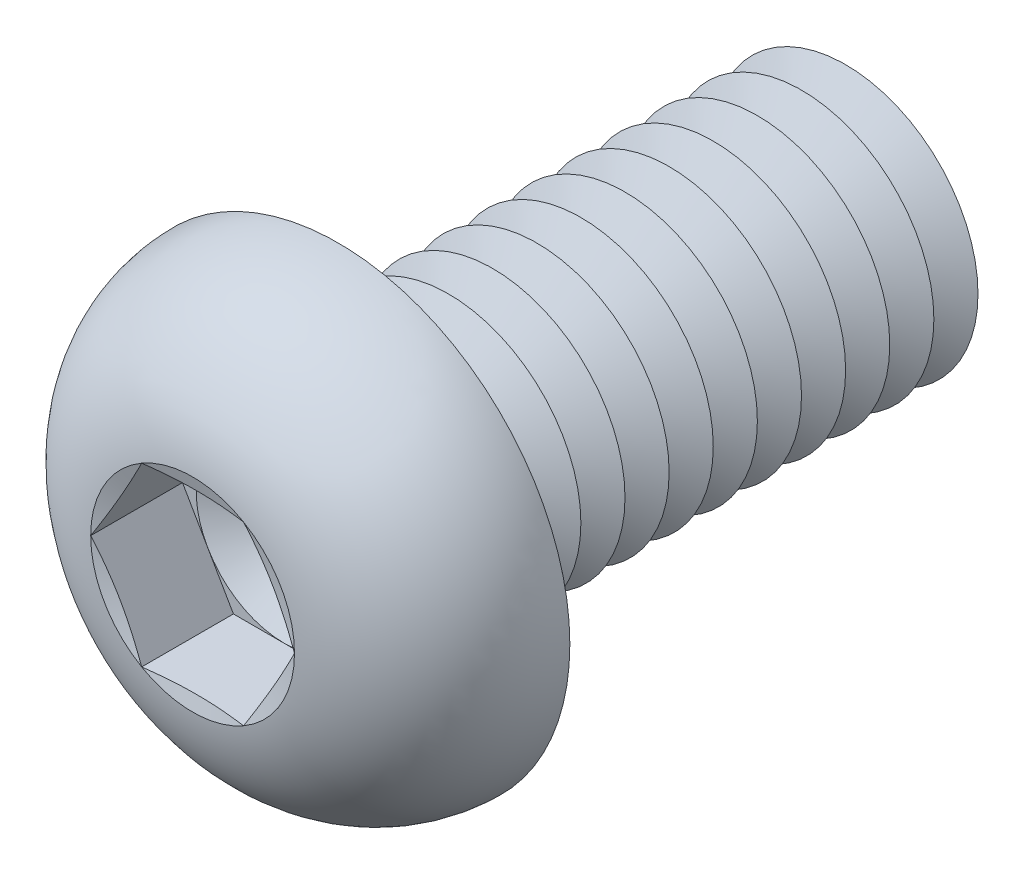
ISO-10303-21;
HEADER;
FILE_DESCRIPTION(('STEP AP214'),'2;1');
FILE_NAME('part.step','',(''),(''),'','','');
FILE_SCHEMA(('AUTOMOTIVE_DESIGN { 1 0 10303 214 1 1 1 1 }'));
ENDSEC;
DATA;
#1=APPLICATION_CONTEXT('core data for automotive mechanical design processes');
#2=APPLICATION_PROTOCOL_DEFINITION('international standard','automotive_design',2000,#1);
#3=PRODUCT_CONTEXT('',#1,'mechanical');
#4=PRODUCT('Part','Part','',(#3));
#5=PRODUCT_RELATED_PRODUCT_CATEGORY('part','',(#4));
#6=PRODUCT_DEFINITION_FORMATION('','',#4);
#7=PRODUCT_DEFINITION_CONTEXT('part definition',#1,'design');
#8=PRODUCT_DEFINITION('design','',#6,#7);
#9=PRODUCT_DEFINITION_SHAPE('','',#8);
#10=(LENGTH_UNIT() NAMED_UNIT(*) SI_UNIT(.MILLI.,.METRE.));
#11=(NAMED_UNIT(*) PLANE_ANGLE_UNIT() SI_UNIT($,.RADIAN.));
#12=(NAMED_UNIT(*) SI_UNIT($,.STERADIAN.) SOLID_ANGLE_UNIT());
#13=UNCERTAINTY_MEASURE_WITH_UNIT(LENGTH_MEASURE(1.E-05),#10,'distance_accuracy_value','');
#14=(GEOMETRIC_REPRESENTATION_CONTEXT(3) GLOBAL_UNCERTAINTY_ASSIGNED_CONTEXT((#13)) GLOBAL_UNIT_ASSIGNED_CONTEXT((#10,
#11,#12)) REPRESENTATION_CONTEXT('',''));
#15=CARTESIAN_POINT('',(0.,0.,0.));
#16=DIRECTION('',(0.,0.,1.));
#17=DIRECTION('',(1.,0.,0.));
#18=AXIS2_PLACEMENT_3D('',#15,#16,#17);
#19=CARTESIAN_POINT('',(0.,0.,1.22));
#20=DIRECTION('',(0.,0.,1.));
#21=DIRECTION('',(1.,0.,0.));
#22=AXIS2_PLACEMENT_3D('',#19,#20,#21);
#23=PLANE('',#22);
#24=CARTESIAN_POINT('',(0.,0.,1.22));
#25=DIRECTION('',(0.,0.,1.));
#26=DIRECTION('',(1.,0.,0.));
#27=AXIS2_PLACEMENT_3D('',#24,#25,#26);
#28=CIRCLE('',#27,1.99999906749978);
#29=CARTESIAN_POINT('',(1.73205,0.999999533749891,1.22));
#30=VERTEX_POINT('',#29);
#31=CARTESIAN_POINT('',(0.,1.99999906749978,1.22));
#32=VERTEX_POINT('',#31);
#33=EDGE_CURVE('E118',#30,#32,#28,.T.);
#34=ORIENTED_EDGE('',*,*,#33,.F.);
#35=DIRECTION('',(-0.5,0.866025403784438,0.));
#36=VECTOR('',#35,1.);
#37=CARTESIAN_POINT('',(2.3094,0.,1.22));
#38=LINE('',#37,#36);
#39=CARTESIAN_POINT('',(1.1547,1.99999906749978,1.22));
#40=VERTEX_POINT('',#39);
#41=EDGE_CURVE('E125',#30,#40,#38,.T.);
#42=ORIENTED_EDGE('',*,*,#41,.T.);
#43=DIRECTION('',(-1.,0.,0.));
#44=VECTOR('',#43,1.);
#45=CARTESIAN_POINT('',(1.1547,1.99999906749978,1.22));
#46=LINE('',#45,#44);
#47=EDGE_CURVE('E136',#40,#32,#46,.T.);
#48=ORIENTED_EDGE('',*,*,#47,.T.);
#49=EDGE_LOOP('',(#34,#42,#48));
#50=FACE_BOUND('',#49,.T.);
#51=ADVANCED_FACE('F39',(#50),#23,.T.);
#52=CARTESIAN_POINT('',(0.,0.,1.22));
#53=DIRECTION('',(0.,0.,1.));
#54=DIRECTION('',(1.,0.,0.));
#55=AXIS2_PLACEMENT_3D('',#52,#53,#54);
#56=CIRCLE('',#55,1.99999906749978);
#57=CARTESIAN_POINT('',(-1.73205,0.999999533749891,1.22));
#58=VERTEX_POINT('',#57);
#59=EDGE_CURVE('E11',#32,#58,#56,.T.);
#60=ORIENTED_EDGE('',*,*,#59,.F.);
#61=CARTESIAN_POINT('',(-1.1547,1.99999906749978,1.22));
#62=VERTEX_POINT('',#61);
#63=EDGE_CURVE('E131',#32,#62,#46,.T.);
#64=ORIENTED_EDGE('',*,*,#63,.T.);
#65=DIRECTION('',(-0.5,-0.866025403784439,0.));
#66=VECTOR('',#65,1.);
#67=CARTESIAN_POINT('',(-1.1547,1.99999906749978,1.22));
#68=LINE('',#67,#66);
#69=EDGE_CURVE('E134',#62,#58,#68,.T.);
#70=ORIENTED_EDGE('',*,*,#69,.T.);
#71=EDGE_LOOP('',(#60,#64,#70));
#72=FACE_BOUND('',#71,.T.);
#73=ADVANCED_FACE('F130',(#72),#23,.T.);
#74=CARTESIAN_POINT('',(-1.73205,-0.999999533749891,1.22));
#75=VERTEX_POINT('',#74);
#76=EDGE_CURVE('E49',#58,#75,#56,.T.);
#77=ORIENTED_EDGE('',*,*,#76,.F.);
#78=CARTESIAN_POINT('',(-2.3094,0.,1.22));
#79=VERTEX_POINT('',#78);
#80=EDGE_CURVE('E143',#58,#79,#68,.T.);
#81=ORIENTED_EDGE('',*,*,#80,.T.);
#82=DIRECTION('',(0.5,-0.866025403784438,0.));
#83=VECTOR('',#82,1.);
#84=CARTESIAN_POINT('',(-2.3094,0.,1.22));
#85=LINE('',#84,#83);
#86=EDGE_CURVE('E152',#79,#75,#85,.T.);
#87=ORIENTED_EDGE('',*,*,#86,.T.);
#88=EDGE_LOOP('',(#77,#81,#87));
#89=FACE_BOUND('',#88,.T.);
#90=ADVANCED_FACE('F363',(#89),#23,.T.);
#91=CARTESIAN_POINT('',(0.,-1.99999906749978,1.22));
#92=VERTEX_POINT('',#91);
#93=EDGE_CURVE('E347',#75,#92,#56,.T.);
#94=ORIENTED_EDGE('',*,*,#93,.F.);
#95=CARTESIAN_POINT('',(-1.1547,-1.99999906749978,1.22));
#96=VERTEX_POINT('',#95);
#97=EDGE_CURVE('E151',#75,#96,#85,.T.);
#98=ORIENTED_EDGE('',*,*,#97,.T.);
#99=DIRECTION('',(1.,0.,0.));
#100=VECTOR('',#99,1.);
#101=CARTESIAN_POINT('',(-1.1547,-1.99999906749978,1.22));
#102=LINE('',#101,#100);
#103=EDGE_CURVE('E157',#96,#92,#102,.T.);
#104=ORIENTED_EDGE('',*,*,#103,.T.);
#105=EDGE_LOOP('',(#94,#98,#104));
#106=FACE_BOUND('',#105,.T.);
#107=ADVANCED_FACE('F356',(#106),#23,.T.);
#108=CARTESIAN_POINT('',(1.73205,-0.999999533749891,1.22));
#109=VERTEX_POINT('',#108);
#110=EDGE_CURVE('E56',#92,#109,#56,.T.);
#111=ORIENTED_EDGE('',*,*,#110,.F.);
#112=CARTESIAN_POINT('',(1.1547,-1.99999906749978,1.22));
#113=VERTEX_POINT('',#112);
#114=EDGE_CURVE('E156',#92,#113,#102,.T.);
#115=ORIENTED_EDGE('',*,*,#114,.T.);
#116=DIRECTION('',(0.5,0.866025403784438,0.));
#117=VECTOR('',#116,1.);
#118=CARTESIAN_POINT('',(1.1547,-1.99999906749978,1.22));
#119=LINE('',#118,#117);
#120=EDGE_CURVE('E162',#113,#109,#119,.T.);
#121=ORIENTED_EDGE('',*,*,#120,.T.);
#122=EDGE_LOOP('',(#111,#115,#121));
#123=FACE_BOUND('',#122,.T.);
#124=ADVANCED_FACE('F436',(#123),#23,.T.);
#125=CARTESIAN_POINT('',(0.,0.,3.3));
#126=DIRECTION('',(0.,0.,1.));
#127=DIRECTION('',(1.,0.,0.));
#128=AXIS2_PLACEMENT_3D('',#125,#126,#127);
#129=CONICAL_SURFACE('',#128,2.3094,1.30899693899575);
#130=CARTESIAN_POINT('',(2.30951547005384,-0.000199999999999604,3.30003094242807));
#131=CARTESIAN_POINT('',(2.26155412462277,0.0828714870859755,3.2871729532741));
#132=CARTESIAN_POINT('',(2.21350580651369,0.16609361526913,3.27549992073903));
#133=CARTESIAN_POINT('',(2.11723944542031,0.332831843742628,3.2549913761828));
#134=CARTESIAN_POINT('',(2.06902134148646,0.416348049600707,3.24615701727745));
#135=CARTESIAN_POINT('',(1.97270782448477,0.583167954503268,3.23184167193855));
#136=CARTESIAN_POINT('',(1.92461306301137,0.666470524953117,3.22634360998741));
#137=CARTESIAN_POINT('',(1.82836219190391,0.83318192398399,3.21897125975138));
#138=CARTESIAN_POINT('',(1.78020609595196,0.91659072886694,3.21709626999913));
#139=CARTESIAN_POINT('',(1.68389390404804,1.08340833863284,3.21709626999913));
#140=CARTESIAN_POINT('',(1.63573780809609,1.16681714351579,3.21897125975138));
#141=CARTESIAN_POINT('',(1.53948693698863,1.33352854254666,3.22634360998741));
#142=CARTESIAN_POINT('',(1.49139217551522,1.41683111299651,3.23184167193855));
#143=CARTESIAN_POINT('',(1.39507865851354,1.58365101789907,3.24615701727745));
#144=CARTESIAN_POINT('',(1.34686055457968,1.66716722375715,3.2549913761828));
#145=CARTESIAN_POINT('',(1.25059419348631,1.83390545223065,3.27549992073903));
#146=CARTESIAN_POINT('',(1.20254587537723,1.91712758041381,3.2871729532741));
#147=CARTESIAN_POINT('',(1.15458452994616,2.00019906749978,3.30003094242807));
#148=B_SPLINE_CURVE_WITH_KNOTS('',3,(#130,#131,#132,#133,#134,#135,#136,#137,#138,#139,#140,
#141,#142,#143,#144,#145,#146,#147),.UNSPECIFIED.,.F.,.F.,(4,2,2,2,2,2,2,2,4),(0.,
0.290357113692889,0.580832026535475,0.869807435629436,1.15872689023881,1.44764634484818,
1.73662175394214,2.02709666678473,2.31745378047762),.UNSPECIFIED.);
#149=CARTESIAN_POINT('',(2.3094,0.,3.3));
#150=VERTEX_POINT('',#149);
#151=CARTESIAN_POINT('',(1.15469999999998,1.99999906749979,3.3));
#152=VERTEX_POINT('',#151);
#153=EDGE_CURVE('E221',#150,#152,#148,.T.);
#154=ORIENTED_EDGE('',*,*,#153,.F.);
#155=CARTESIAN_POINT('',(0.,0.,3.3));
#156=DIRECTION('',(0.,0.,-1.));
#157=DIRECTION('',(-1.,0.,0.));
#158=AXIS2_PLACEMENT_3D('',#155,#156,#157);
#159=CIRCLE('',#158,2.3094);
#160=EDGE_CURVE('E393',#152,#150,#159,.T.);
#161=ORIENTED_EDGE('',*,*,#160,.F.);
#162=EDGE_LOOP('',(#154,#161));
#163=FACE_BOUND('',#162,.T.);
#164=ADVANCED_FACE('F440',(#163),#129,.F.);
#165=CARTESIAN_POINT('',(1.15458452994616,-2.00019906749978,3.30003094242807));
#166=CARTESIAN_POINT('',(1.20254587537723,-1.91712758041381,3.2871729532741));
#167=CARTESIAN_POINT('',(1.25059419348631,-1.83390545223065,3.27549992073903));
#168=CARTESIAN_POINT('',(1.34686055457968,-1.66716722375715,3.2549913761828));
#169=CARTESIAN_POINT('',(1.39507865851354,-1.58365101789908,3.24615701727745));
#170=CARTESIAN_POINT('',(1.49139217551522,-1.41683111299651,3.23184167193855));
#171=CARTESIAN_POINT('',(1.53948693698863,-1.33352854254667,3.22634360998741));
#172=CARTESIAN_POINT('',(1.63573780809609,-1.16681714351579,3.21897125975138));
#173=CARTESIAN_POINT('',(1.68389390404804,-1.08340833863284,3.21709626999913));
#174=CARTESIAN_POINT('',(1.78020609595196,-0.916590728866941,3.21709626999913));
#175=CARTESIAN_POINT('',(1.82836219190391,-0.833181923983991,3.21897125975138));
#176=CARTESIAN_POINT('',(1.92461306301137,-0.666470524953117,3.22634360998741));
#177=CARTESIAN_POINT('',(1.97270782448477,-0.583167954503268,3.23184167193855));
#178=CARTESIAN_POINT('',(2.06902134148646,-0.416348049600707,3.24615701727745));
#179=CARTESIAN_POINT('',(2.11723944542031,-0.332831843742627,3.2549913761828));
#180=CARTESIAN_POINT('',(2.21350580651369,-0.166093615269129,3.27549992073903));
#181=CARTESIAN_POINT('',(2.26155412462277,-0.082871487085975,3.2871729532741));
#182=CARTESIAN_POINT('',(2.30951547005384,0.000200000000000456,3.30003094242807));
#183=B_SPLINE_CURVE_WITH_KNOTS('',3,(#165,#166,#167,#168,#169,#170,#171,#172,#173,#174,#175,
#176,#177,#178,#179,#180,#181,#182),.UNSPECIFIED.,.F.,.F.,(4,2,2,2,2,2,2,2,4),(0.,
0.290357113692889,0.580832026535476,0.869807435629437,1.15872689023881,1.44764634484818,
1.73662175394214,2.02709666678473,2.31745378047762),.UNSPECIFIED.);
#184=CARTESIAN_POINT('',(1.1547,-1.99999906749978,3.3));
#185=VERTEX_POINT('',#184);
#186=EDGE_CURVE('E230',#185,#150,#183,.T.);
#187=ORIENTED_EDGE('',*,*,#186,.F.);
#188=EDGE_CURVE('E395',#150,#185,#159,.T.);
#189=ORIENTED_EDGE('',*,*,#188,.F.);
#190=EDGE_LOOP('',(#187,#189));
#191=FACE_BOUND('',#190,.T.);
#192=ADVANCED_FACE('F401',(#191),#129,.F.);
#193=CARTESIAN_POINT('',(-3.4849337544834,-1.99999906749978,3.75783251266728));
#194=CARTESIAN_POINT('',(-3.40057136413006,-1.99999906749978,3.7382285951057));
#195=CARTESIAN_POINT('',(-3.31617090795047,-1.99999906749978,3.71878852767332));
#196=CARTESIAN_POINT('',(-3.14727791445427,-1.99999906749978,3.68030638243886));
#197=CARTESIAN_POINT('',(-3.06278537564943,-1.99999906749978,3.66126431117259));
#198=CARTESIAN_POINT('',(-2.80911712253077,-1.99999906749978,3.604834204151));
#199=CARTESIAN_POINT('',(-2.63978343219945,-1.99999906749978,3.5681499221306));
#200=CARTESIAN_POINT('',(-2.29895421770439,-1.99999906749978,3.49717072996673));
#201=CARTESIAN_POINT('',(-2.12745330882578,-1.99999906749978,3.4629014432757));
#202=CARTESIAN_POINT('',(-1.78364663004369,-1.99999906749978,3.39849485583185));
#203=CARTESIAN_POINT('',(-1.61134079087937,-1.99999906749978,3.36835791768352));
#204=CARTESIAN_POINT('',(-1.27040784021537,-1.99999906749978,3.31501553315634));
#205=CARTESIAN_POINT('',(-1.10180724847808,-1.99999906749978,3.29164468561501));
#206=CARTESIAN_POINT('',(-0.76364137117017,-1.99999906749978,3.2533727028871));
#207=CARTESIAN_POINT('',(-0.594076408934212,-1.99999906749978,3.23846888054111));
#208=CARTESIAN_POINT('',(-0.33964912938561,-1.99999906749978,3.22431372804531));
#209=CARTESIAN_POINT('',(-0.255009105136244,-1.99999906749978,3.22096057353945));
#210=CARTESIAN_POINT('',(-0.0856618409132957,-1.99999906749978,3.21711210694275));
#211=CARTESIAN_POINT('',(-0.000954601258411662,-1.99999906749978,3.21661678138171));
#212=CARTESIAN_POINT('',(0.168430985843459,-1.99999906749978,3.21851478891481));
#213=CARTESIAN_POINT('',(0.253109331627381,-1.99999906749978,3.22090826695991));
#214=CARTESIAN_POINT('',(0.422344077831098,-1.99999906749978,3.22845792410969));
#215=CARTESIAN_POINT('',(0.506900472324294,-1.99999906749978,3.23361423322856));
#216=CARTESIAN_POINT('',(0.712240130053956,-1.99999906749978,3.24921577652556));
#217=CARTESIAN_POINT('',(0.832922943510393,-1.99999906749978,3.26098285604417));
#218=CARTESIAN_POINT('',(1.07378161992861,-1.99999906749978,3.28874908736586));
#219=CARTESIAN_POINT('',(1.1939575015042,-1.99999906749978,3.30474808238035));
#220=CARTESIAN_POINT('',(1.43419655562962,-1.99999906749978,3.34009172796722));
#221=CARTESIAN_POINT('',(1.55425817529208,-1.99999906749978,3.35944677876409));
#222=CARTESIAN_POINT('',(1.79394991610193,-1.99999906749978,3.40067076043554));
#223=CARTESIAN_POINT('',(1.91358001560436,-1.99999906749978,3.42253981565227));
#224=CARTESIAN_POINT('',(2.15493405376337,-1.99999906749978,3.46864194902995));
#225=CARTESIAN_POINT('',(2.27665041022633,-1.99999906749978,3.49291441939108));
#226=CARTESIAN_POINT('',(2.51977680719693,-1.99999906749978,3.54294628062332));
#227=CARTESIAN_POINT('',(2.64118684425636,-1.99999906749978,3.56870568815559));
#228=CARTESIAN_POINT('',(2.88310060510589,-1.99999906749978,3.6212089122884));
#229=CARTESIAN_POINT('',(3.00360566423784,-1.99999906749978,3.6479466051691));
#230=CARTESIAN_POINT('',(3.24441021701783,-1.99999906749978,3.70229477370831));
#231=CARTESIAN_POINT('',(3.36470972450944,-1.99999906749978,3.7299051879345));
#232=CARTESIAN_POINT('',(3.4849337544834,-1.99999906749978,3.75783251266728));
#233=B_SPLINE_CURVE_WITH_KNOTS('',3,(#193,#194,#195,#196,#197,#198,#199,#200,#201,#202,#203,
#204,#205,#206,#207,#208,#209,#210,#211,#212,#213,#214,#215,#216,#217,#218,#219,#220,#221,#222,
#223,#224,#225,#226,#227,#228,#229,#230,#231,#232),.UNSPECIFIED.,.F.,.F.,(4,2,2,2,2,2,2,2,2,2,2,
2,2,2,2,2,2,2,2,4),(0.,0.259830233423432,0.519664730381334,1.03943435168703,1.56407662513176,
2.08876490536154,2.59926476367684,3.10960251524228,3.36367930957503,3.61775490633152,
3.87184325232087,4.1259435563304,4.48960924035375,4.85326145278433,5.21806142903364,
5.58287945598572,5.95520617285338,6.32753706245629,6.69784064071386,7.06811821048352),.UNSPECIFIED.);
#234=CARTESIAN_POINT('',(-1.1547,-1.99999906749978,3.3));
#235=VERTEX_POINT('',#234);
#236=EDGE_CURVE('E375',#235,#185,#233,.T.);
#237=ORIENTED_EDGE('',*,*,#236,.F.);
#238=EDGE_CURVE('E383',#185,#235,#159,.T.);
#239=ORIENTED_EDGE('',*,*,#238,.F.);
#240=EDGE_LOOP('',(#237,#239));
#241=FACE_BOUND('',#240,.T.);
#242=ADVANCED_FACE('F407',(#241),#129,.F.);
#243=CARTESIAN_POINT('',(-2.30951547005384,0.000200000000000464,3.30003094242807));
#244=CARTESIAN_POINT('',(-2.26155412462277,-0.0828714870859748,3.2871729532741));
#245=CARTESIAN_POINT('',(-2.21350580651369,-0.166093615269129,3.27549992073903));
#246=CARTESIAN_POINT('',(-2.11723944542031,-0.332831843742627,3.2549913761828));
#247=CARTESIAN_POINT('',(-2.06902134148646,-0.416348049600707,3.24615701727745));
#248=CARTESIAN_POINT('',(-1.97270782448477,-0.583167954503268,3.23184167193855));
#249=CARTESIAN_POINT('',(-1.92461306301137,-0.666470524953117,3.22634360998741));
#250=CARTESIAN_POINT('',(-1.82836219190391,-0.833181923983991,3.21897125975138));
#251=CARTESIAN_POINT('',(-1.78020609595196,-0.916590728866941,3.21709626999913));
#252=CARTESIAN_POINT('',(-1.68389390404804,-1.08340833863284,3.21709626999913));
#253=CARTESIAN_POINT('',(-1.63573780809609,-1.16681714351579,3.21897125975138));
#254=CARTESIAN_POINT('',(-1.53948693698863,-1.33352854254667,3.22634360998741));
#255=CARTESIAN_POINT('',(-1.49139217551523,-1.41683111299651,3.23184167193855));
#256=CARTESIAN_POINT('',(-1.39507865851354,-1.58365101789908,3.24615701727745));
#257=CARTESIAN_POINT('',(-1.34686055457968,-1.66716722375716,3.2549913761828));
#258=CARTESIAN_POINT('',(-1.25059419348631,-1.83390545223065,3.27549992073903));
#259=CARTESIAN_POINT('',(-1.20254587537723,-1.91712758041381,3.2871729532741));
#260=CARTESIAN_POINT('',(-1.15458452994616,-2.00019906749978,3.30003094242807));
#261=B_SPLINE_CURVE_WITH_KNOTS('',3,(#243,#244,#245,#246,#247,#248,#249,#250,#251,#252,#253,
#254,#255,#256,#257,#258,#259,#260),.UNSPECIFIED.,.F.,.F.,(4,2,2,2,2,2,2,2,4),(0.,
0.290357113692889,0.580832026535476,0.869807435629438,1.15872689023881,1.44764634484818,
1.73662175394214,2.02709666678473,2.31745378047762),.UNSPECIFIED.);
#262=CARTESIAN_POINT('',(-2.3094,0.,3.3));
#263=VERTEX_POINT('',#262);
#264=EDGE_CURVE('E368',#263,#235,#261,.T.);
#265=ORIENTED_EDGE('',*,*,#264,.F.);
#266=EDGE_CURVE('E330',#235,#263,#159,.T.);
#267=ORIENTED_EDGE('',*,*,#266,.F.);
#268=EDGE_LOOP('',(#265,#267));
#269=FACE_BOUND('',#268,.T.);
#270=ADVANCED_FACE('F372',(#269),#129,.F.);
#271=CARTESIAN_POINT('',(-1.15458452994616,2.00019906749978,3.30003094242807));
#272=CARTESIAN_POINT('',(-1.20254587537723,1.91712758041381,3.2871729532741));
#273=CARTESIAN_POINT('',(-1.25059419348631,1.83390545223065,3.27549992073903));
#274=CARTESIAN_POINT('',(-1.34686055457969,1.66716722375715,3.2549913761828));
#275=CARTESIAN_POINT('',(-1.39507865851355,1.58365101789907,3.24615701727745));
#276=CARTESIAN_POINT('',(-1.49139217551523,1.41683111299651,3.23184167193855));
#277=CARTESIAN_POINT('',(-1.53948693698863,1.33352854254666,3.22634360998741));
#278=CARTESIAN_POINT('',(-1.63573780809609,1.16681714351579,3.21897125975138));
#279=CARTESIAN_POINT('',(-1.68389390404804,1.08340833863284,3.21709626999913));
#280=CARTESIAN_POINT('',(-1.78020609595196,0.91659072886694,3.21709626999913));
#281=CARTESIAN_POINT('',(-1.82836219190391,0.83318192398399,3.21897125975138));
#282=CARTESIAN_POINT('',(-1.92461306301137,0.666470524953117,3.22634360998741));
#283=CARTESIAN_POINT('',(-1.97270782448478,0.583167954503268,3.23184167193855));
#284=CARTESIAN_POINT('',(-2.06902134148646,0.416348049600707,3.24615701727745));
#285=CARTESIAN_POINT('',(-2.11723944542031,0.332831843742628,3.2549913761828));
#286=CARTESIAN_POINT('',(-2.21350580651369,0.16609361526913,3.27549992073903));
#287=CARTESIAN_POINT('',(-2.26155412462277,0.0828714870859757,3.2871729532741));
#288=CARTESIAN_POINT('',(-2.30951547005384,-0.000199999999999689,3.30003094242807));
#289=B_SPLINE_CURVE_WITH_KNOTS('',3,(#271,#272,#273,#274,#275,#276,#277,#278,#279,#280,#281,
#282,#283,#284,#285,#286,#287,#288),.UNSPECIFIED.,.F.,.F.,(4,2,2,2,2,2,2,2,4),(0.,
0.290357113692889,0.580832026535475,0.869807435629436,1.15872689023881,1.44764634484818,
1.73662175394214,2.02709666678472,2.31745378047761),.UNSPECIFIED.);
#290=CARTESIAN_POINT('',(-1.1547,1.99999906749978,3.3));
#291=VERTEX_POINT('',#290);
#292=EDGE_CURVE('E195',#291,#263,#289,.T.);
#293=ORIENTED_EDGE('',*,*,#292,.F.);
#294=EDGE_CURVE('E331',#263,#291,#159,.T.);
#295=ORIENTED_EDGE('',*,*,#294,.F.);
#296=EDGE_LOOP('',(#293,#295));
#297=FACE_BOUND('',#296,.T.);
#298=ADVANCED_FACE('F386',(#297),#129,.F.);
#299=CARTESIAN_POINT('',(0.,0.,-8.5));
#300=DIRECTION('',(0.,0.,1.));
#301=DIRECTION('',(1.,0.,0.));
#302=AXIS2_PLACEMENT_3D('',#299,#300,#301);
#303=CONICAL_SURFACE('',#302,3.,1.0471975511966);
#304=CARTESIAN_POINT('',(0.,0.,-9.));
#305=DIRECTION('',(0.,0.,1.));
#306=DIRECTION('',(1.,0.,0.));
#307=AXIS2_PLACEMENT_3D('',#304,#305,#306);
#308=CIRCLE('',#307,2.13397459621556);
#309=CARTESIAN_POINT('',(2.13397459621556,0.,-9.));
#310=VERTEX_POINT('',#309);
#311=EDGE_CURVE('E303',#310,#310,#308,.T.);
#312=ORIENTED_EDGE('',*,*,#311,.T.);
#313=EDGE_LOOP('',(#312));
#314=FACE_BOUND('',#313,.T.);
#315=CARTESIAN_POINT('',(0.,0.,-8.5));
#316=DIRECTION('',(0.,0.,1.));
#317=DIRECTION('',(1.,0.,0.));
#318=AXIS2_PLACEMENT_3D('',#315,#316,#317);
#319=CIRCLE('',#318,3.);
#320=CARTESIAN_POINT('',(3.,0.,-8.5));
#321=VERTEX_POINT('',#320);
#322=EDGE_CURVE('E299',#321,#321,#319,.T.);
#323=ORIENTED_EDGE('',*,*,#322,.F.);
#324=EDGE_LOOP('',(#323));
#325=FACE_BOUND('',#324,.T.);
#326=ADVANCED_FACE('F574',(#314,#325),#303,.T.);
#327=CARTESIAN_POINT('',(0.,0.,-9.));
#328=DIRECTION('',(0.,0.,-1.));
#329=DIRECTION('',(-1.,0.,0.));
#330=AXIS2_PLACEMENT_3D('',#327,#328,#329);
#331=CONICAL_SURFACE('',#330,2.13397459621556,1.0471975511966);
#332=CARTESIAN_POINT('',(0.,0.,-9.5));
#333=DIRECTION('',(0.,0.,1.));
#334=DIRECTION('',(1.,0.,0.));
#335=AXIS2_PLACEMENT_3D('',#332,#333,#334);
#336=CIRCLE('',#335,3.);
#337=CARTESIAN_POINT('',(3.,0.,-9.5));
#338=VERTEX_POINT('',#337);
#339=EDGE_CURVE('E307',#338,#338,#336,.T.);
#340=ORIENTED_EDGE('',*,*,#339,.T.);
#341=EDGE_LOOP('',(#340));
#342=FACE_BOUND('',#341,.T.);
#343=ORIENTED_EDGE('',*,*,#311,.F.);
#344=EDGE_LOOP('',(#343));
#345=FACE_BOUND('',#344,.T.);
#346=ADVANCED_FACE('F776',(#342,#345),#331,.T.);
#347=CARTESIAN_POINT('',(0.,3.00000000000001,-12.));
#348=DIRECTION('',(0.,0.,-1.));
#349=DIRECTION('',(-1.,0.,0.));
#350=AXIS2_PLACEMENT_3D('',#347,#348,#349);
#351=PLANE('',#350);
#352=CARTESIAN_POINT('',(0.,0.,-12.));
#353=DIRECTION('',(0.,0.,1.));
#354=DIRECTION('',(1.,0.,0.));
#355=AXIS2_PLACEMENT_3D('',#352,#353,#354);
#356=CIRCLE('',#355,2.13397459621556);
#357=CARTESIAN_POINT('',(2.13397459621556,0.,-12.));
#358=VERTEX_POINT('',#357);
#359=EDGE_CURVE('E327',#358,#358,#356,.T.);
#360=ORIENTED_EDGE('',*,*,#359,.F.);
#361=EDGE_LOOP('',(#360));
#362=FACE_BOUND('',#361,.T.);
#363=ADVANCED_FACE('F781',(#362),#351,.T.);
#364=CARTESIAN_POINT('',(0.,0.,-11.5));
#365=DIRECTION('',(0.,0.,1.));
#366=DIRECTION('',(1.,0.,0.));
#367=AXIS2_PLACEMENT_3D('',#364,#365,#366);
#368=CONICAL_SURFACE('',#367,3.,1.0471975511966);
#369=ORIENTED_EDGE('',*,*,#359,.T.);
#370=EDGE_LOOP('',(#369));
#371=FACE_BOUND('',#370,.T.);
#372=CARTESIAN_POINT('',(0.,0.,-11.5));
#373=DIRECTION('',(0.,0.,1.));
#374=DIRECTION('',(1.,0.,0.));
#375=AXIS2_PLACEMENT_3D('',#372,#373,#374);
#376=CIRCLE('',#375,3.);
#377=CARTESIAN_POINT('',(3.,0.,-11.5));
#378=VERTEX_POINT('',#377);
#379=EDGE_CURVE('E323',#378,#378,#376,.T.);
#380=ORIENTED_EDGE('',*,*,#379,.F.);
#381=EDGE_LOOP('',(#380));
#382=FACE_BOUND('',#381,.T.);
#383=ADVANCED_FACE('F770',(#371,#382),#368,.T.);
#384=CARTESIAN_POINT('',(0.,0.,-11.));
#385=DIRECTION('',(0.,0.,-1.));
#386=DIRECTION('',(-1.,0.,0.));
#387=AXIS2_PLACEMENT_3D('',#384,#385,#386);
#388=CONICAL_SURFACE('',#387,2.13397459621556,1.0471975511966);
#389=ORIENTED_EDGE('',*,*,#379,.T.);
#390=EDGE_LOOP('',(#389));
#391=FACE_BOUND('',#390,.T.);
#392=CARTESIAN_POINT('',(0.,0.,-11.));
#393=DIRECTION('',(0.,0.,1.));
#394=DIRECTION('',(1.,0.,0.));
#395=AXIS2_PLACEMENT_3D('',#392,#393,#394);
#396=CIRCLE('',#395,2.13397459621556);
#397=CARTESIAN_POINT('',(2.13397459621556,0.,-11.));
#398=VERTEX_POINT('',#397);
#399=EDGE_CURVE('E319',#398,#398,#396,.T.);
#400=ORIENTED_EDGE('',*,*,#399,.F.);
#401=EDGE_LOOP('',(#400));
#402=FACE_BOUND('',#401,.T.);
#403=ADVANCED_FACE('F760',(#391,#402),#388,.T.);
#404=CARTESIAN_POINT('',(0.,0.,-10.5));
#405=DIRECTION('',(0.,0.,1.));
#406=DIRECTION('',(1.,0.,0.));
#407=AXIS2_PLACEMENT_3D('',#404,#405,#406);
#408=CONICAL_SURFACE('',#407,3.,1.0471975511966);
#409=ORIENTED_EDGE('',*,*,#399,.T.);
#410=EDGE_LOOP('',(#409));
#411=FACE_BOUND('',#410,.T.);
#412=CARTESIAN_POINT('',(0.,0.,-10.5));
#413=DIRECTION('',(0.,0.,1.));
#414=DIRECTION('',(1.,0.,0.));
#415=AXIS2_PLACEMENT_3D('',#412,#413,#414);
#416=CIRCLE('',#415,3.);
#417=CARTESIAN_POINT('',(3.,0.,-10.5));
#418=VERTEX_POINT('',#417);
#419=EDGE_CURVE('E315',#418,#418,#416,.T.);
#420=ORIENTED_EDGE('',*,*,#419,.F.);
#421=EDGE_LOOP('',(#420));
#422=FACE_BOUND('',#421,.T.);
#423=ADVANCED_FACE('F750',(#411,#422),#408,.T.);
#424=CARTESIAN_POINT('',(0.,0.,-10.));
#425=DIRECTION('',(0.,0.,-1.));
#426=DIRECTION('',(-1.,0.,0.));
#427=AXIS2_PLACEMENT_3D('',#424,#425,#426);
#428=CONICAL_SURFACE('',#427,2.13397459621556,1.0471975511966);
#429=ORIENTED_EDGE('',*,*,#419,.T.);
#430=EDGE_LOOP('',(#429));
#431=FACE_BOUND('',#430,.T.);
#432=CARTESIAN_POINT('',(0.,0.,-10.));
#433=DIRECTION('',(0.,0.,1.));
#434=DIRECTION('',(1.,0.,0.));
#435=AXIS2_PLACEMENT_3D('',#432,#433,#434);
#436=CIRCLE('',#435,2.13397459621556);
#437=CARTESIAN_POINT('',(2.13397459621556,0.,-10.));
#438=VERTEX_POINT('',#437);
#439=EDGE_CURVE('E311',#438,#438,#436,.T.);
#440=ORIENTED_EDGE('',*,*,#439,.F.);
#441=EDGE_LOOP('',(#440));
#442=FACE_BOUND('',#441,.T.);
#443=ADVANCED_FACE('F740',(#431,#442),#428,.T.);
#444=CARTESIAN_POINT('',(0.,0.,-9.5));
#445=DIRECTION('',(0.,0.,1.));
#446=DIRECTION('',(1.,0.,0.));
#447=AXIS2_PLACEMENT_3D('',#444,#445,#446);
#448=CONICAL_SURFACE('',#447,3.,1.0471975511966);
#449=ORIENTED_EDGE('',*,*,#439,.T.);
#450=EDGE_LOOP('',(#449));
#451=FACE_BOUND('',#450,.T.);
#452=ORIENTED_EDGE('',*,*,#339,.F.);
#453=EDGE_LOOP('',(#452));
#454=FACE_BOUND('',#453,.T.);
#455=ADVANCED_FACE('F730',(#451,#454),#448,.T.);
#456=CARTESIAN_POINT('',(0.,0.,-7.5));
#457=DIRECTION('',(0.,0.,1.));
#458=DIRECTION('',(1.,0.,0.));
#459=AXIS2_PLACEMENT_3D('',#456,#457,#458);
#460=CONICAL_SURFACE('',#459,3.,1.0471975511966);
#461=CARTESIAN_POINT('',(0.,0.,-8.));
#462=DIRECTION('',(0.,0.,1.));
#463=DIRECTION('',(1.,0.,0.));
#464=AXIS2_PLACEMENT_3D('',#461,#462,#463);
#465=CIRCLE('',#464,2.13397459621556);
#466=CARTESIAN_POINT('',(2.13397459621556,0.,-8.));
#467=VERTEX_POINT('',#466);
#468=EDGE_CURVE('E295',#467,#467,#465,.T.);
#469=ORIENTED_EDGE('',*,*,#468,.T.);
#470=EDGE_LOOP('',(#469));
#471=FACE_BOUND('',#470,.T.);
#472=CARTESIAN_POINT('',(0.,0.,-7.5));
#473=DIRECTION('',(0.,0.,1.));
#474=DIRECTION('',(1.,0.,0.));
#475=AXIS2_PLACEMENT_3D('',#472,#473,#474);
#476=CIRCLE('',#475,3.);
#477=CARTESIAN_POINT('',(3.,0.,-7.5));
#478=VERTEX_POINT('',#477);
#479=EDGE_CURVE('E291',#478,#478,#476,.T.);
#480=ORIENTED_EDGE('',*,*,#479,.F.);
#481=EDGE_LOOP('',(#480));
#482=FACE_BOUND('',#481,.T.);
#483=ADVANCED_FACE('F720',(#471,#482),#460,.T.);
#484=CARTESIAN_POINT('',(0.,0.,-8.));
#485=DIRECTION('',(0.,0.,-1.));
#486=DIRECTION('',(-1.,0.,0.));
#487=AXIS2_PLACEMENT_3D('',#484,#485,#486);
#488=CONICAL_SURFACE('',#487,2.13397459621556,1.0471975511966);
#489=ORIENTED_EDGE('',*,*,#322,.T.);
#490=EDGE_LOOP('',(#489));
#491=FACE_BOUND('',#490,.T.);
#492=ORIENTED_EDGE('',*,*,#468,.F.);
#493=EDGE_LOOP('',(#492));
#494=FACE_BOUND('',#493,.T.);
#495=ADVANCED_FACE('F710',(#491,#494),#488,.T.);
#496=CARTESIAN_POINT('',(0.,0.,-6.5));
#497=DIRECTION('',(0.,0.,1.));
#498=DIRECTION('',(1.,0.,0.));
#499=AXIS2_PLACEMENT_3D('',#496,#497,#498);
#500=CONICAL_SURFACE('',#499,3.,1.0471975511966);
#501=CARTESIAN_POINT('',(0.,0.,-7.));
#502=DIRECTION('',(0.,0.,1.));
#503=DIRECTION('',(1.,0.,0.));
#504=AXIS2_PLACEMENT_3D('',#501,#502,#503);
#505=CIRCLE('',#504,2.13397459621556);
#506=CARTESIAN_POINT('',(2.13397459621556,0.,-7.));
#507=VERTEX_POINT('',#506);
#508=EDGE_CURVE('E287',#507,#507,#505,.T.);
#509=ORIENTED_EDGE('',*,*,#508,.T.);
#510=EDGE_LOOP('',(#509));
#511=FACE_BOUND('',#510,.T.);
#512=CARTESIAN_POINT('',(0.,0.,-6.5));
#513=DIRECTION('',(0.,0.,1.));
#514=DIRECTION('',(1.,0.,0.));
#515=AXIS2_PLACEMENT_3D('',#512,#513,#514);
#516=CIRCLE('',#515,3.);
#517=CARTESIAN_POINT('',(3.,0.,-6.5));
#518=VERTEX_POINT('',#517);
#519=EDGE_CURVE('E283',#518,#518,#516,.T.);
#520=ORIENTED_EDGE('',*,*,#519,.F.);
#521=EDGE_LOOP('',(#520));
#522=FACE_BOUND('',#521,.T.);
#523=ADVANCED_FACE('F700',(#511,#522),#500,.T.);
#524=CARTESIAN_POINT('',(0.,0.,-7.));
#525=DIRECTION('',(0.,0.,-1.));
#526=DIRECTION('',(-1.,0.,0.));
#527=AXIS2_PLACEMENT_3D('',#524,#525,#526);
#528=CONICAL_SURFACE('',#527,2.13397459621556,1.0471975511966);
#529=ORIENTED_EDGE('',*,*,#479,.T.);
#530=EDGE_LOOP('',(#529));
#531=FACE_BOUND('',#530,.T.);
#532=ORIENTED_EDGE('',*,*,#508,.F.);
#533=EDGE_LOOP('',(#532));
#534=FACE_BOUND('',#533,.T.);
#535=ADVANCED_FACE('F690',(#531,#534),#528,.T.);
#536=CARTESIAN_POINT('',(0.,0.,-5.5));
#537=DIRECTION('',(0.,0.,1.));
#538=DIRECTION('',(1.,0.,0.));
#539=AXIS2_PLACEMENT_3D('',#536,#537,#538);
#540=CONICAL_SURFACE('',#539,3.,1.0471975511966);
#541=CARTESIAN_POINT('',(0.,0.,-6.));
#542=DIRECTION('',(0.,0.,1.));
#543=DIRECTION('',(1.,0.,0.));
#544=AXIS2_PLACEMENT_3D('',#541,#542,#543);
#545=CIRCLE('',#544,2.13397459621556);
#546=CARTESIAN_POINT('',(2.13397459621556,0.,-6.));
#547=VERTEX_POINT('',#546);
#548=EDGE_CURVE('E279',#547,#547,#545,.T.);
#549=ORIENTED_EDGE('',*,*,#548,.T.);
#550=EDGE_LOOP('',(#549));
#551=FACE_BOUND('',#550,.T.);
#552=CARTESIAN_POINT('',(0.,0.,-5.5));
#553=DIRECTION('',(0.,0.,1.));
#554=DIRECTION('',(1.,0.,0.));
#555=AXIS2_PLACEMENT_3D('',#552,#553,#554);
#556=CIRCLE('',#555,3.);
#557=CARTESIAN_POINT('',(3.,0.,-5.5));
#558=VERTEX_POINT('',#557);
#559=EDGE_CURVE('E275',#558,#558,#556,.T.);
#560=ORIENTED_EDGE('',*,*,#559,.F.);
#561=EDGE_LOOP('',(#560));
#562=FACE_BOUND('',#561,.T.);
#563=ADVANCED_FACE('F680',(#551,#562),#540,.T.);
#564=CARTESIAN_POINT('',(0.,0.,-6.));
#565=DIRECTION('',(0.,0.,-1.));
#566=DIRECTION('',(-1.,0.,0.));
#567=AXIS2_PLACEMENT_3D('',#564,#565,#566);
#568=CONICAL_SURFACE('',#567,2.13397459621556,1.0471975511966);
#569=ORIENTED_EDGE('',*,*,#519,.T.);
#570=EDGE_LOOP('',(#569));
#571=FACE_BOUND('',#570,.T.);
#572=ORIENTED_EDGE('',*,*,#548,.F.);
#573=EDGE_LOOP('',(#572));
#574=FACE_BOUND('',#573,.T.);
#575=ADVANCED_FACE('F670',(#571,#574),#568,.T.);
#576=CARTESIAN_POINT('',(0.,0.,-4.5));
#577=DIRECTION('',(0.,0.,1.));
#578=DIRECTION('',(1.,0.,0.));
#579=AXIS2_PLACEMENT_3D('',#576,#577,#578);
#580=CONICAL_SURFACE('',#579,3.,1.0471975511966);
#581=CARTESIAN_POINT('',(0.,0.,-5.));
#582=DIRECTION('',(0.,0.,1.));
#583=DIRECTION('',(1.,0.,0.));
#584=AXIS2_PLACEMENT_3D('',#581,#582,#583);
#585=CIRCLE('',#584,2.13397459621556);
#586=CARTESIAN_POINT('',(2.13397459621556,0.,-5.));
#587=VERTEX_POINT('',#586);
#588=EDGE_CURVE('E271',#587,#587,#585,.T.);
#589=ORIENTED_EDGE('',*,*,#588,.T.);
#590=EDGE_LOOP('',(#589));
#591=FACE_BOUND('',#590,.T.);
#592=CARTESIAN_POINT('',(0.,0.,-4.5));
#593=DIRECTION('',(0.,0.,1.));
#594=DIRECTION('',(1.,0.,0.));
#595=AXIS2_PLACEMENT_3D('',#592,#593,#594);
#596=CIRCLE('',#595,3.);
#597=CARTESIAN_POINT('',(3.,0.,-4.5));
#598=VERTEX_POINT('',#597);
#599=EDGE_CURVE('E267',#598,#598,#596,.T.);
#600=ORIENTED_EDGE('',*,*,#599,.F.);
#601=EDGE_LOOP('',(#600));
#602=FACE_BOUND('',#601,.T.);
#603=ADVANCED_FACE('F660',(#591,#602),#580,.T.);
#604=CARTESIAN_POINT('',(0.,0.,-5.));
#605=DIRECTION('',(0.,0.,-1.));
#606=DIRECTION('',(-1.,0.,0.));
#607=AXIS2_PLACEMENT_3D('',#604,#605,#606);
#608=CONICAL_SURFACE('',#607,2.13397459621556,1.0471975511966);
#609=ORIENTED_EDGE('',*,*,#559,.T.);
#610=EDGE_LOOP('',(#609));
#611=FACE_BOUND('',#610,.T.);
#612=ORIENTED_EDGE('',*,*,#588,.F.);
#613=EDGE_LOOP('',(#612));
#614=FACE_BOUND('',#613,.T.);
#615=ADVANCED_FACE('F650',(#611,#614),#608,.T.);
#616=CARTESIAN_POINT('',(0.,0.,-3.5));
#617=DIRECTION('',(0.,0.,1.));
#618=DIRECTION('',(1.,0.,0.));
#619=AXIS2_PLACEMENT_3D('',#616,#617,#618);
#620=CONICAL_SURFACE('',#619,3.,1.0471975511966);
#621=CARTESIAN_POINT('',(0.,0.,-4.));
#622=DIRECTION('',(0.,0.,1.));
#623=DIRECTION('',(1.,0.,0.));
#624=AXIS2_PLACEMENT_3D('',#621,#622,#623);
#625=CIRCLE('',#624,2.13397459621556);
#626=CARTESIAN_POINT('',(2.13397459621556,0.,-4.));
#627=VERTEX_POINT('',#626);
#628=EDGE_CURVE('E263',#627,#627,#625,.T.);
#629=ORIENTED_EDGE('',*,*,#628,.T.);
#630=EDGE_LOOP('',(#629));
#631=FACE_BOUND('',#630,.T.);
#632=CARTESIAN_POINT('',(0.,0.,-3.5));
#633=DIRECTION('',(0.,0.,1.));
#634=DIRECTION('',(1.,0.,0.));
#635=AXIS2_PLACEMENT_3D('',#632,#633,#634);
#636=CIRCLE('',#635,3.);
#637=CARTESIAN_POINT('',(3.,0.,-3.5));
#638=VERTEX_POINT('',#637);
#639=EDGE_CURVE('E259',#638,#638,#636,.T.);
#640=ORIENTED_EDGE('',*,*,#639,.F.);
#641=EDGE_LOOP('',(#640));
#642=FACE_BOUND('',#641,.T.);
#643=ADVANCED_FACE('F640',(#631,#642),#620,.T.);
#644=CARTESIAN_POINT('',(0.,0.,-4.));
#645=DIRECTION('',(0.,0.,-1.));
#646=DIRECTION('',(-1.,0.,0.));
#647=AXIS2_PLACEMENT_3D('',#644,#645,#646);
#648=CONICAL_SURFACE('',#647,2.13397459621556,1.0471975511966);
#649=ORIENTED_EDGE('',*,*,#599,.T.);
#650=EDGE_LOOP('',(#649));
#651=FACE_BOUND('',#650,.T.);
#652=ORIENTED_EDGE('',*,*,#628,.F.);
#653=EDGE_LOOP('',(#652));
#654=FACE_BOUND('',#653,.T.);
#655=ADVANCED_FACE('F630',(#651,#654),#648,.T.);
#656=CARTESIAN_POINT('',(0.,0.,-2.5));
#657=DIRECTION('',(0.,0.,1.));
#658=DIRECTION('',(1.,0.,0.));
#659=AXIS2_PLACEMENT_3D('',#656,#657,#658);
#660=CONICAL_SURFACE('',#659,3.,1.0471975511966);
#661=CARTESIAN_POINT('',(0.,0.,-3.));
#662=DIRECTION('',(0.,0.,1.));
#663=DIRECTION('',(1.,0.,0.));
#664=AXIS2_PLACEMENT_3D('',#661,#662,#663);
#665=CIRCLE('',#664,2.13397459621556);
#666=CARTESIAN_POINT('',(2.13397459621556,0.,-3.));
#667=VERTEX_POINT('',#666);
#668=EDGE_CURVE('E256',#667,#667,#665,.T.);
#669=ORIENTED_EDGE('',*,*,#668,.T.);
#670=EDGE_LOOP('',(#669));
#671=FACE_BOUND('',#670,.T.);
#672=CARTESIAN_POINT('',(0.,0.,-2.5));
#673=DIRECTION('',(0.,0.,1.));
#674=DIRECTION('',(1.,0.,0.));
#675=AXIS2_PLACEMENT_3D('',#672,#673,#674);
#676=CIRCLE('',#675,3.);
#677=CARTESIAN_POINT('',(3.,0.,-2.5));
#678=VERTEX_POINT('',#677);
#679=EDGE_CURVE('E252',#678,#678,#676,.T.);
#680=ORIENTED_EDGE('',*,*,#679,.F.);
#681=EDGE_LOOP('',(#680));
#682=FACE_BOUND('',#681,.T.);
#683=ADVANCED_FACE('F620',(#671,#682),#660,.T.);
#684=CARTESIAN_POINT('',(0.,0.,-3.));
#685=DIRECTION('',(0.,0.,-1.));
#686=DIRECTION('',(-1.,0.,0.));
#687=AXIS2_PLACEMENT_3D('',#684,#685,#686);
#688=CONICAL_SURFACE('',#687,2.13397459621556,1.0471975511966);
#689=ORIENTED_EDGE('',*,*,#639,.T.);
#690=EDGE_LOOP('',(#689));
#691=FACE_BOUND('',#690,.T.);
#692=ORIENTED_EDGE('',*,*,#668,.F.);
#693=EDGE_LOOP('',(#692));
#694=FACE_BOUND('',#693,.T.);
#695=ADVANCED_FACE('F610',(#691,#694),#688,.T.);
#696=CARTESIAN_POINT('',(0.,0.,-1.5));
#697=DIRECTION('',(0.,0.,1.));
#698=DIRECTION('',(1.,0.,0.));
#699=AXIS2_PLACEMENT_3D('',#696,#697,#698);
#700=CONICAL_SURFACE('',#699,3.,1.0471975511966);
#701=CARTESIAN_POINT('',(0.,0.,-2.));
#702=DIRECTION('',(0.,0.,1.));
#703=DIRECTION('',(1.,0.,0.));
#704=AXIS2_PLACEMENT_3D('',#701,#702,#703);
#705=CIRCLE('',#704,2.13397459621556);
#706=CARTESIAN_POINT('',(2.13397459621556,0.,-2.));
#707=VERTEX_POINT('',#706);
#708=EDGE_CURVE('E248',#707,#707,#705,.T.);
#709=ORIENTED_EDGE('',*,*,#708,.T.);
#710=EDGE_LOOP('',(#709));
#711=FACE_BOUND('',#710,.T.);
#712=CARTESIAN_POINT('',(0.,0.,-1.5));
#713=DIRECTION('',(0.,0.,1.));
#714=DIRECTION('',(1.,0.,0.));
#715=AXIS2_PLACEMENT_3D('',#712,#713,#714);
#716=CIRCLE('',#715,3.);
#717=CARTESIAN_POINT('',(3.,0.,-1.5));
#718=VERTEX_POINT('',#717);
#719=EDGE_CURVE('E240',#718,#718,#716,.T.);
#720=ORIENTED_EDGE('',*,*,#719,.F.);
#721=EDGE_LOOP('',(#720));
#722=FACE_BOUND('',#721,.T.);
#723=ADVANCED_FACE('F600',(#711,#722),#700,.T.);
#724=CARTESIAN_POINT('',(0.,0.,-2.));
#725=DIRECTION('',(0.,0.,-1.));
#726=DIRECTION('',(-1.,0.,0.));
#727=AXIS2_PLACEMENT_3D('',#724,#725,#726);
#728=CONICAL_SURFACE('',#727,2.13397459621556,1.0471975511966);
#729=ORIENTED_EDGE('',*,*,#679,.T.);
#730=EDGE_LOOP('',(#729));
#731=FACE_BOUND('',#730,.T.);
#732=ORIENTED_EDGE('',*,*,#708,.F.);
#733=EDGE_LOOP('',(#732));
#734=FACE_BOUND('',#733,.T.);
#735=ADVANCED_FACE('F591',(#731,#734),#728,.T.);
#736=CARTESIAN_POINT('',(0.,0.,-0.5));
#737=DIRECTION('',(0.,0.,1.));
#738=DIRECTION('',(1.,0.,0.));
#739=AXIS2_PLACEMENT_3D('',#736,#737,#738);
#740=CONICAL_SURFACE('',#739,3.,1.0471975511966);
#741=CARTESIAN_POINT('',(0.,0.,-0.999999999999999));
#742=DIRECTION('',(0.,0.,1.));
#743=DIRECTION('',(1.,0.,0.));
#744=AXIS2_PLACEMENT_3D('',#741,#742,#743);
#745=CIRCLE('',#744,2.13397459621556);
#746=CARTESIAN_POINT('',(2.13397459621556,0.,-0.999999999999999));
#747=VERTEX_POINT('',#746);
#748=EDGE_CURVE('E229',#747,#747,#745,.T.);
#749=ORIENTED_EDGE('',*,*,#748,.T.);
#750=EDGE_LOOP('',(#749));
#751=FACE_BOUND('',#750,.T.);
#752=CARTESIAN_POINT('',(0.,0.,-0.5));
#753=DIRECTION('',(0.,0.,1.));
#754=DIRECTION('',(1.,0.,0.));
#755=AXIS2_PLACEMENT_3D('',#752,#753,#754);
#756=CIRCLE('',#755,3.);
#757=CARTESIAN_POINT('',(3.,0.,-0.5));
#758=VERTEX_POINT('',#757);
#759=EDGE_CURVE('E244',#758,#758,#756,.T.);
#760=ORIENTED_EDGE('',*,*,#759,.F.);
#761=EDGE_LOOP('',(#760));
#762=FACE_BOUND('',#761,.T.);
#763=ADVANCED_FACE('F582',(#751,#762),#740,.T.);
#764=CARTESIAN_POINT('',(0.,0.,-0.999999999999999));
#765=DIRECTION('',(0.,0.,-1.));
#766=DIRECTION('',(-1.,0.,0.));
#767=AXIS2_PLACEMENT_3D('',#764,#765,#766);
#768=CONICAL_SURFACE('',#767,2.13397459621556,1.0471975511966);
#769=ORIENTED_EDGE('',*,*,#719,.T.);
#770=EDGE_LOOP('',(#769));
#771=FACE_BOUND('',#770,.T.);
#772=ORIENTED_EDGE('',*,*,#748,.F.);
#773=EDGE_LOOP('',(#772));
#774=FACE_BOUND('',#773,.T.);
#775=ADVANCED_FACE('F218',(#771,#774),#768,.T.);
#776=CARTESIAN_POINT('',(3.4849337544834,1.99999906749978,3.75783251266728));
#777=CARTESIAN_POINT('',(3.40057136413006,1.99999906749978,3.7382285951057));
#778=CARTESIAN_POINT('',(3.31617090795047,1.99999906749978,3.71878852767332));
#779=CARTESIAN_POINT('',(3.14727791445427,1.99999906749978,3.68030638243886));
#780=CARTESIAN_POINT('',(3.06278537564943,1.99999906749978,3.66126431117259));
#781=CARTESIAN_POINT('',(2.80911712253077,1.99999906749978,3.604834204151));
#782=CARTESIAN_POINT('',(2.63978343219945,1.99999906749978,3.5681499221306));
#783=CARTESIAN_POINT('',(2.29895421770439,1.99999906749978,3.49717072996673));
#784=CARTESIAN_POINT('',(2.12745330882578,1.99999906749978,3.4629014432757));
#785=CARTESIAN_POINT('',(1.78364663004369,1.99999906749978,3.39849485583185));
#786=CARTESIAN_POINT('',(1.61134079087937,1.99999906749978,3.36835791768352));
#787=CARTESIAN_POINT('',(1.27040784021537,1.99999906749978,3.31501553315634));
#788=CARTESIAN_POINT('',(1.10180724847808,1.99999906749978,3.29164468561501));
#789=CARTESIAN_POINT('',(0.763641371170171,1.99999906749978,3.2533727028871));
#790=CARTESIAN_POINT('',(0.594076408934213,1.99999906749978,3.23846888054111));
#791=CARTESIAN_POINT('',(0.339649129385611,1.99999906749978,3.22431372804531));
#792=CARTESIAN_POINT('',(0.255009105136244,1.99999906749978,3.22096057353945));
#793=CARTESIAN_POINT('',(0.0856618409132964,1.99999906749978,3.21711210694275));
#794=CARTESIAN_POINT('',(0.000954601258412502,1.99999906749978,3.2166167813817));
#795=CARTESIAN_POINT('',(-0.168430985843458,1.99999906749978,3.21851478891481));
#796=CARTESIAN_POINT('',(-0.25310933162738,1.99999906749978,3.22090826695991));
#797=CARTESIAN_POINT('',(-0.422344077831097,1.99999906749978,3.22845792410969));
#798=CARTESIAN_POINT('',(-0.506900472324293,1.99999906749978,3.23361423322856));
#799=CARTESIAN_POINT('',(-0.712240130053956,1.99999906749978,3.24921577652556));
#800=CARTESIAN_POINT('',(-0.832922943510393,1.99999906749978,3.26098285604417));
#801=CARTESIAN_POINT('',(-1.07378161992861,1.99999906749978,3.28874908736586));
#802=CARTESIAN_POINT('',(-1.1939575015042,1.99999906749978,3.30474808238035));
#803=CARTESIAN_POINT('',(-1.43419655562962,1.99999906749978,3.34009172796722));
#804=CARTESIAN_POINT('',(-1.55425817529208,1.99999906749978,3.35944677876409));
#805=CARTESIAN_POINT('',(-1.79394991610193,1.99999906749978,3.40067076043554));
#806=CARTESIAN_POINT('',(-1.91358001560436,1.99999906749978,3.42253981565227));
#807=CARTESIAN_POINT('',(-2.15493405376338,1.99999906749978,3.46864194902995));
#808=CARTESIAN_POINT('',(-2.27665041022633,1.99999906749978,3.49291441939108));
#809=CARTESIAN_POINT('',(-2.51977680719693,1.99999906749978,3.54294628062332));
#810=CARTESIAN_POINT('',(-2.64118684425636,1.99999906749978,3.56870568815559));
#811=CARTESIAN_POINT('',(-2.8831006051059,1.99999906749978,3.6212089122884));
#812=CARTESIAN_POINT('',(-3.00360566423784,1.99999906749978,3.6479466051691));
#813=CARTESIAN_POINT('',(-3.24441021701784,1.99999906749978,3.70229477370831));
#814=CARTESIAN_POINT('',(-3.36470972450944,1.99999906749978,3.7299051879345));
#815=CARTESIAN_POINT('',(-3.4849337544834,1.99999906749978,3.75783251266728));
#816=B_SPLINE_CURVE_WITH_KNOTS('',3,(#776,#777,#778,#779,#780,#781,#782,#783,#784,#785,#786,
#787,#788,#789,#790,#791,#792,#793,#794,#795,#796,#797,#798,#799,#800,#801,#802,#803,#804,#805,
#806,#807,#808,#809,#810,#811,#812,#813,#814,#815),.UNSPECIFIED.,.F.,.F.,(4,2,2,2,2,2,2,2,2,2,2,
2,2,2,2,2,2,2,2,4),(0.,0.259830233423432,0.519664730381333,1.03943435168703,1.56407662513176,
2.08876490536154,2.59926476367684,3.10960251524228,3.36367930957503,3.61775490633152,
3.87184325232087,4.1259435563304,4.48960924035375,4.85326145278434,5.21806142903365,
5.58287945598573,5.95520617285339,6.3275370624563,6.69784064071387,7.06811821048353),.UNSPECIFIED.);
#817=EDGE_CURVE('E170',#152,#291,#816,.T.);
#818=ORIENTED_EDGE('',*,*,#817,.F.);
#819=EDGE_CURVE('E336',#291,#152,#159,.T.);
#820=ORIENTED_EDGE('',*,*,#819,.F.);
#821=EDGE_LOOP('',(#818,#820));
#822=FACE_BOUND('',#821,.T.);
#823=ADVANCED_FACE('F202',(#822),#129,.F.);
#824=CARTESIAN_POINT('',(0.,0.,0.));
#825=DIRECTION('',(0.,0.,-1.));
#826=DIRECTION('',(-1.,0.,0.));
#827=AXIS2_PLACEMENT_3D('',#824,#825,#826);
#828=DEGENERATE_TOROIDAL_SURFACE('',#827,1.92803707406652,3.32196292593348,.T.);
#829=ORIENTED_EDGE('',*,*,#294,.T.);
#830=ORIENTED_EDGE('',*,*,#819,.T.);
#831=ORIENTED_EDGE('',*,*,#160,.T.);
#832=ORIENTED_EDGE('',*,*,#188,.T.);
#833=ORIENTED_EDGE('',*,*,#238,.T.);
#834=ORIENTED_EDGE('',*,*,#266,.T.);
#835=EDGE_LOOP('',(#829,#830,#831,#832,#833,#834));
#836=FACE_BOUND('',#835,.T.);
#837=CARTESIAN_POINT('',(0.,0.,0.));
#838=DIRECTION('',(0.,0.,-1.));
#839=DIRECTION('',(-1.,0.,0.));
#840=AXIS2_PLACEMENT_3D('',#837,#838,#839);
#841=CIRCLE('',#840,5.25);
#842=CARTESIAN_POINT('',(-5.25,0.,0.));
#843=VERTEX_POINT('',#842);
#844=EDGE_CURVE('E335',#843,#843,#841,.T.);
#845=ORIENTED_EDGE('',*,*,#844,.F.);
#846=EDGE_LOOP('',(#845));
#847=FACE_BOUND('',#846,.T.);
#848=ADVANCED_FACE('F378',(#836,#847),#828,.T.);
#849=CARTESIAN_POINT('',(0.,3.,0.));
#850=DIRECTION('',(0.,0.,-1.));
#851=DIRECTION('',(-1.,0.,0.));
#852=AXIS2_PLACEMENT_3D('',#849,#850,#851);
#853=PLANE('',#852);
#854=CARTESIAN_POINT('',(0.,0.,0.));
#855=DIRECTION('',(0.,0.,-1.));
#856=DIRECTION('',(-1.,0.,0.));
#857=AXIS2_PLACEMENT_3D('',#854,#855,#856);
#858=CIRCLE('',#857,3.5);
#859=CARTESIAN_POINT('',(-3.5,0.,0.));
#860=VERTEX_POINT('',#859);
#861=EDGE_CURVE('E339',#860,#860,#858,.F.);
#862=ORIENTED_EDGE('',*,*,#861,.T.);
#863=EDGE_LOOP('',(#862));
#864=FACE_BOUND('',#863,.T.);
#865=ORIENTED_EDGE('',*,*,#844,.T.);
#866=EDGE_LOOP('',(#865));
#867=FACE_BOUND('',#866,.T.);
#868=ADVANCED_FACE('F816',(#864,#867),#853,.T.);
#869=CARTESIAN_POINT('',(0.,0.,-0.5));
#870=DIRECTION('',(0.,0.,-1.));
#871=DIRECTION('',(-1.,0.,0.));
#872=AXIS2_PLACEMENT_3D('',#869,#870,#871);
#873=TOROIDAL_SURFACE('',#872,3.5,0.5);
#874=ORIENTED_EDGE('',*,*,#861,.F.);
#875=EDGE_LOOP('',(#874));
#876=FACE_BOUND('',#875,.T.);
#877=ORIENTED_EDGE('',*,*,#759,.T.);
#878=EDGE_LOOP('',(#877));
#879=FACE_BOUND('',#878,.T.);
#880=ADVANCED_FACE('F41',(#876,#879),#873,.F.);
#881=CARTESIAN_POINT('',(2.3094,0.,1.22));
#882=DIRECTION('',(0.866025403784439,0.5,0.));
#883=DIRECTION('',(-0.5,0.866025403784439,0.));
#884=AXIS2_PLACEMENT_3D('',#881,#882,#883);
#885=PLANE('',#884);
#886=ORIENTED_EDGE('',*,*,#153,.T.);
#887=DIRECTION('',(0.,0.,1.));
#888=VECTOR('',#887,1.);
#889=CARTESIAN_POINT('',(1.1547,1.99999906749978,1.22));
#890=LINE('',#889,#888);
#891=EDGE_CURVE('E64',#40,#152,#890,.T.);
#892=ORIENTED_EDGE('',*,*,#891,.F.);
#893=ORIENTED_EDGE('',*,*,#41,.F.);
#894=CARTESIAN_POINT('',(2.3094,0.,1.22));
#895=VERTEX_POINT('',#894);
#896=EDGE_CURVE('E140',#895,#30,#38,.T.);
#897=ORIENTED_EDGE('',*,*,#896,.F.);
#898=DIRECTION('',(0.,0.,1.));
#899=VECTOR('',#898,1.);
#900=CARTESIAN_POINT('',(2.3094,0.,1.22));
#901=LINE('',#900,#899);
#902=EDGE_CURVE('E166',#895,#150,#901,.T.);
#903=ORIENTED_EDGE('',*,*,#902,.T.);
#904=EDGE_LOOP('',(#886,#892,#893,#897,#903));
#905=FACE_BOUND('',#904,.T.);
#906=ADVANCED_FACE('F212',(#905),#885,.F.);
#907=CARTESIAN_POINT('',(1.1547,-1.99999906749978,1.22));
#908=DIRECTION('',(0.866025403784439,-0.5,0.));
#909=DIRECTION('',(0.5,0.866025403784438,0.));
#910=AXIS2_PLACEMENT_3D('',#907,#908,#909);
#911=PLANE('',#910);
#912=ORIENTED_EDGE('',*,*,#186,.T.);
#913=ORIENTED_EDGE('',*,*,#902,.F.);
#914=EDGE_CURVE('E161',#109,#895,#119,.T.);
#915=ORIENTED_EDGE('',*,*,#914,.F.);
#916=ORIENTED_EDGE('',*,*,#120,.F.);
#917=DIRECTION('',(0.,0.,1.));
#918=VECTOR('',#917,1.);
#919=CARTESIAN_POINT('',(1.1547,-1.99999906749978,1.22));
#920=LINE('',#919,#918);
#921=EDGE_CURVE('E171',#113,#185,#920,.T.);
#922=ORIENTED_EDGE('',*,*,#921,.T.);
#923=EDGE_LOOP('',(#912,#913,#915,#916,#922));
#924=FACE_BOUND('',#923,.T.);
#925=ADVANCED_FACE('F216',(#924),#911,.F.);
#926=CARTESIAN_POINT('',(-1.1547,-1.99999906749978,1.22));
#927=DIRECTION('',(0.,-1.,0.));
#928=DIRECTION('',(0.,0.,-1.));
#929=AXIS2_PLACEMENT_3D('',#926,#927,#928);
#930=PLANE('',#929);
#931=ORIENTED_EDGE('',*,*,#236,.T.);
#932=ORIENTED_EDGE('',*,*,#921,.F.);
#933=ORIENTED_EDGE('',*,*,#114,.F.);
#934=ORIENTED_EDGE('',*,*,#103,.F.);
#935=DIRECTION('',(0.,0.,1.));
#936=VECTOR('',#935,1.);
#937=CARTESIAN_POINT('',(-1.1547,-1.99999906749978,1.22));
#938=LINE('',#937,#936);
#939=EDGE_CURVE('E175',#96,#235,#938,.T.);
#940=ORIENTED_EDGE('',*,*,#939,.T.);
#941=EDGE_LOOP('',(#931,#932,#933,#934,#940));
#942=FACE_BOUND('',#941,.T.);
#943=ADVANCED_FACE('F420',(#942),#930,.F.);
#944=CARTESIAN_POINT('',(-2.3094,0.,1.22));
#945=DIRECTION('',(-0.866025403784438,-0.5,0.));
#946=DIRECTION('',(0.5,-0.866025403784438,0.));
#947=AXIS2_PLACEMENT_3D('',#944,#945,#946);
#948=PLANE('',#947);
#949=ORIENTED_EDGE('',*,*,#264,.T.);
#950=ORIENTED_EDGE('',*,*,#939,.F.);
#951=ORIENTED_EDGE('',*,*,#97,.F.);
#952=ORIENTED_EDGE('',*,*,#86,.F.);
#953=DIRECTION('',(0.,0.,1.));
#954=VECTOR('',#953,1.);
#955=CARTESIAN_POINT('',(-2.3094,0.,1.22));
#956=LINE('',#955,#954);
#957=EDGE_CURVE('E179',#79,#263,#956,.T.);
#958=ORIENTED_EDGE('',*,*,#957,.T.);
#959=EDGE_LOOP('',(#949,#950,#951,#952,#958));
#960=FACE_BOUND('',#959,.T.);
#961=ADVANCED_FACE('F361',(#960),#948,.F.);
#962=CARTESIAN_POINT('',(-1.1547,1.99999906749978,1.22));
#963=DIRECTION('',(-0.866025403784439,0.5,0.));
#964=DIRECTION('',(-0.5,-0.866025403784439,0.));
#965=AXIS2_PLACEMENT_3D('',#962,#963,#964);
#966=PLANE('',#965);
#967=ORIENTED_EDGE('',*,*,#292,.T.);
#968=ORIENTED_EDGE('',*,*,#957,.F.);
#969=ORIENTED_EDGE('',*,*,#80,.F.);
#970=ORIENTED_EDGE('',*,*,#69,.F.);
#971=DIRECTION('',(0.,0.,1.));
#972=VECTOR('',#971,1.);
#973=CARTESIAN_POINT('',(-1.1547,1.99999906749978,1.22));
#974=LINE('',#973,#972);
#975=EDGE_CURVE('E138',#62,#291,#974,.T.);
#976=ORIENTED_EDGE('',*,*,#975,.T.);
#977=EDGE_LOOP('',(#967,#968,#969,#970,#976));
#978=FACE_BOUND('',#977,.T.);
#979=ADVANCED_FACE('F209',(#978),#966,.F.);
#980=CARTESIAN_POINT('',(1.1547,1.99999906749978,1.22));
#981=DIRECTION('',(0.,1.,0.));
#982=DIRECTION('',(-1.,0.,0.));
#983=AXIS2_PLACEMENT_3D('',#980,#981,#982);
#984=PLANE('',#983);
#985=ORIENTED_EDGE('',*,*,#817,.T.);
#986=ORIENTED_EDGE('',*,*,#975,.F.);
#987=ORIENTED_EDGE('',*,*,#63,.F.);
#988=ORIENTED_EDGE('',*,*,#47,.F.);
#989=ORIENTED_EDGE('',*,*,#891,.T.);
#990=EDGE_LOOP('',(#985,#986,#987,#988,#989));
#991=FACE_BOUND('',#990,.T.);
#992=ADVANCED_FACE('F135',(#991),#984,.F.);
#993=EDGE_CURVE('E43',#109,#30,#56,.T.);
#994=ORIENTED_EDGE('',*,*,#993,.F.);
#995=ORIENTED_EDGE('',*,*,#914,.T.);
#996=ORIENTED_EDGE('',*,*,#896,.T.);
#997=EDGE_LOOP('',(#994,#995,#996));
#998=FACE_BOUND('',#997,.T.);
#999=ADVANCED_FACE('F115',(#998),#23,.T.);
#1000=CARTESIAN_POINT('',(0.,0.,1.22));
#1001=DIRECTION('',(0.,0.,1.));
#1002=DIRECTION('',(1.,0.,0.));
#1003=AXIS2_PLACEMENT_3D('',#1000,#1001,#1002);
#1004=CONICAL_SURFACE('',#1003,1.99999906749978,1.0471975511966);
#1005=CARTESIAN_POINT('',(0.,0.,0.0653000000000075));
#1006=VERTEX_POINT('',#1005);
#1007=VERTEX_LOOP('',#1006);
#1008=FACE_BOUND('',#1007,.T.);
#1009=ORIENTED_EDGE('',*,*,#33,.T.);
#1010=ORIENTED_EDGE('',*,*,#59,.T.);
#1011=ORIENTED_EDGE('',*,*,#76,.T.);
#1012=ORIENTED_EDGE('',*,*,#93,.T.);
#1013=ORIENTED_EDGE('',*,*,#110,.T.);
#1014=ORIENTED_EDGE('',*,*,#993,.T.);
#1015=EDGE_LOOP('',(#1009,#1010,#1011,#1012,#1013,#1014));
#1016=FACE_BOUND('',#1015,.T.);
#1017=ADVANCED_FACE('F113',(#1008,#1016),#1004,.F.);
#1018=CLOSED_SHELL('',(#51,#73,#90,#107,#124,#164,#192,#242,#270,#298,#326,#346,#363,#383,#403,
#423,#443,#455,#483,#495,#523,#535,#563,#575,#603,#615,#643,#655,#683,#695,#723,#735,#763,#775,
#823,#848,#868,#880,#906,#925,#943,#961,#979,#992,#999,#1017));
#1019=MANIFOLD_SOLID_BREP('B2',#1018);
#1020=ADVANCED_BREP_SHAPE_REPRESENTATION('',(#18,#1019),#14);
#1021=SHAPE_DEFINITION_REPRESENTATION(#9,#1020);
ENDSEC;
END-ISO-10303-21;
